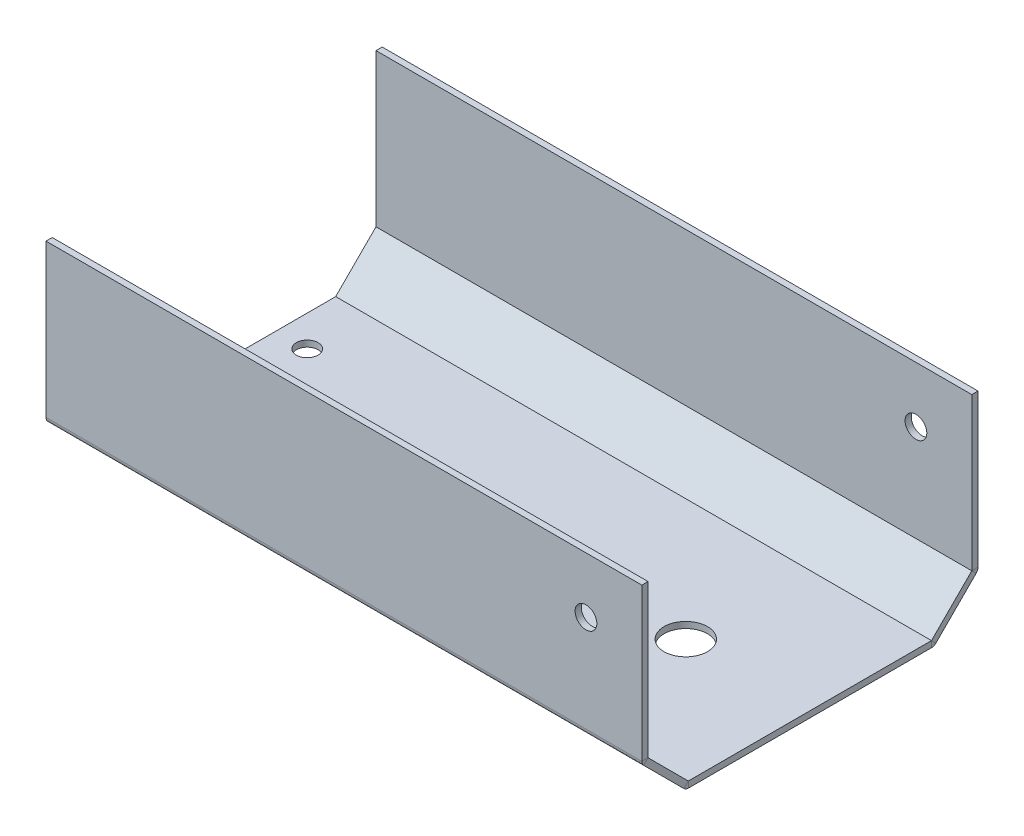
ISO-10303-21;
HEADER;
FILE_DESCRIPTION(('STEP AP214'),'2;1');
FILE_NAME('part.step','',(''),(''),'','','');
FILE_SCHEMA(('AUTOMOTIVE_DESIGN { 1 0 10303 214 1 1 1 1 }'));
ENDSEC;
DATA;
#1=APPLICATION_CONTEXT('core data for automotive mechanical design processes');
#2=APPLICATION_PROTOCOL_DEFINITION('international standard','automotive_design',2000,#1);
#3=PRODUCT_CONTEXT('',#1,'mechanical');
#4=PRODUCT('Part','Part','',(#3));
#5=PRODUCT_RELATED_PRODUCT_CATEGORY('part','',(#4));
#6=PRODUCT_DEFINITION_FORMATION('','',#4);
#7=PRODUCT_DEFINITION_CONTEXT('part definition',#1,'design');
#8=PRODUCT_DEFINITION('design','',#6,#7);
#9=PRODUCT_DEFINITION_SHAPE('','',#8);
#10=(LENGTH_UNIT() NAMED_UNIT(*) SI_UNIT(.MILLI.,.METRE.));
#11=(NAMED_UNIT(*) PLANE_ANGLE_UNIT() SI_UNIT($,.RADIAN.));
#12=(NAMED_UNIT(*) SI_UNIT($,.STERADIAN.) SOLID_ANGLE_UNIT());
#13=UNCERTAINTY_MEASURE_WITH_UNIT(LENGTH_MEASURE(1.E-05),#10,'distance_accuracy_value','');
#14=(GEOMETRIC_REPRESENTATION_CONTEXT(3) GLOBAL_UNCERTAINTY_ASSIGNED_CONTEXT((#13)) GLOBAL_UNIT_ASSIGNED_CONTEXT((#10,
#11,#12)) REPRESENTATION_CONTEXT('',''));
#15=CARTESIAN_POINT('',(0.,0.,0.));
#16=DIRECTION('',(0.,0.,1.));
#17=DIRECTION('',(1.,0.,0.));
#18=AXIS2_PLACEMENT_3D('',#15,#16,#17);
#19=CARTESIAN_POINT('',(0.,1.,-110.));
#20=DIRECTION('',(0.,-1.,0.));
#21=DIRECTION('',(0.,0.,-1.));
#22=AXIS2_PLACEMENT_3D('',#19,#20,#21);
#23=PLANE('',#22);
#24=CARTESIAN_POINT('',(5.,1.,-65.));
#25=DIRECTION('',(0.,1.,0.));
#26=DIRECTION('',(0.,0.,1.));
#27=AXIS2_PLACEMENT_3D('',#24,#25,#26);
#28=CIRCLE('',#27,1.75);
#29=CARTESIAN_POINT('',(5.,1.,-63.25));
#30=VERTEX_POINT('',#29);
#31=EDGE_CURVE('E340',#30,#30,#28,.T.);
#32=ORIENTED_EDGE('',*,*,#31,.F.);
#33=EDGE_LOOP('',(#32));
#34=FACE_BOUND('',#33,.T.);
#35=CARTESIAN_POINT('',(76.,1.,-55.));
#36=DIRECTION('',(0.,1.,0.));
#37=DIRECTION('',(0.,0.,1.));
#38=AXIS2_PLACEMENT_3D('',#35,#36,#37);
#39=CIRCLE('',#38,3.50000000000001);
#40=CARTESIAN_POINT('',(76.,1.,-51.5));
#41=VERTEX_POINT('',#40);
#42=EDGE_CURVE('E346',#41,#41,#39,.T.);
#43=ORIENTED_EDGE('',*,*,#42,.F.);
#44=EDGE_LOOP('',(#43));
#45=FACE_BOUND('',#44,.T.);
#46=CARTESIAN_POINT('',(5.,1.,-45.));
#47=DIRECTION('',(0.,1.,0.));
#48=DIRECTION('',(0.,0.,1.));
#49=AXIS2_PLACEMENT_3D('',#46,#47,#48);
#50=CIRCLE('',#49,1.75);
#51=CARTESIAN_POINT('',(5.,1.,-43.25));
#52=VERTEX_POINT('',#51);
#53=EDGE_CURVE('E334',#52,#52,#50,.T.);
#54=ORIENTED_EDGE('',*,*,#53,.F.);
#55=EDGE_LOOP('',(#54));
#56=FACE_BOUND('',#55,.T.);
#57=DIRECTION('',(0.,0.,1.));
#58=VECTOR('',#57,1.);
#59=CARTESIAN_POINT('',(0.,1.,0.));
#60=LINE('',#59,#58);
#61=CARTESIAN_POINT('',(0.,0.999999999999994,-74.5907864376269));
#62=VERTEX_POINT('',#61);
#63=CARTESIAN_POINT('',(0.,1.,-35.4092135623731));
#64=VERTEX_POINT('',#63);
#65=EDGE_CURVE('E52',#62,#64,#60,.T.);
#66=ORIENTED_EDGE('',*,*,#65,.T.);
#67=DIRECTION('',(1.,0.,0.));
#68=VECTOR('',#67,1.);
#69=CARTESIAN_POINT('',(0.,1.,-35.4092135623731));
#70=LINE('',#69,#68);
#71=CARTESIAN_POINT('',(96.,1.,-35.4092135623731));
#72=VERTEX_POINT('',#71);
#73=EDGE_CURVE('E361',#64,#72,#70,.T.);
#74=ORIENTED_EDGE('',*,*,#73,.T.);
#75=DIRECTION('',(0.,0.,-1.));
#76=VECTOR('',#75,1.);
#77=CARTESIAN_POINT('',(96.,1.,0.));
#78=LINE('',#77,#76);
#79=CARTESIAN_POINT('',(96.,1.,-74.5907864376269));
#80=VERTEX_POINT('',#79);
#81=EDGE_CURVE('E353',#72,#80,#78,.T.);
#82=ORIENTED_EDGE('',*,*,#81,.T.);
#83=DIRECTION('',(1.,0.,0.));
#84=VECTOR('',#83,1.);
#85=CARTESIAN_POINT('',(0.,1.,-74.5907864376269));
#86=LINE('',#85,#84);
#87=EDGE_CURVE('E349',#62,#80,#86,.T.);
#88=ORIENTED_EDGE('',*,*,#87,.F.);
#89=EDGE_LOOP('',(#66,#74,#82,#88));
#90=FACE_BOUND('',#89,.T.);
#91=ADVANCED_FACE('F48',(#34,#45,#56,#90),#23,.F.);
#92=CARTESIAN_POINT('',(0.,1.,0.));
#93=DIRECTION('',(1.,0.,0.));
#94=DIRECTION('',(0.,0.,-1.));
#95=AXIS2_PLACEMENT_3D('',#92,#93,#94);
#96=PLANE('',#95);
#97=DIRECTION('',(0.,0.,1.));
#98=VECTOR('',#97,1.);
#99=CARTESIAN_POINT('',(0.,0.,0.));
#100=LINE('',#99,#98);
#101=CARTESIAN_POINT('',(0.,0.,-74.5907864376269));
#102=VERTEX_POINT('',#101);
#103=CARTESIAN_POINT('',(0.,0.,-35.4092135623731));
#104=VERTEX_POINT('',#103);
#105=EDGE_CURVE('E71',#102,#104,#100,.T.);
#106=ORIENTED_EDGE('',*,*,#105,.T.);
#107=DIRECTION('',(0.,1.,0.));
#108=VECTOR('',#107,1.);
#109=CARTESIAN_POINT('',(0.,0.999999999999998,-35.4092135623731));
#110=LINE('',#109,#108);
#111=EDGE_CURVE('E364',#104,#64,#110,.T.);
#112=ORIENTED_EDGE('',*,*,#111,.T.);
#113=ORIENTED_EDGE('',*,*,#65,.F.);
#114=DIRECTION('',(0.,1.,0.));
#115=VECTOR('',#114,1.);
#116=CARTESIAN_POINT('',(0.,0.999999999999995,-74.5907864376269));
#117=LINE('',#116,#115);
#118=EDGE_CURVE('E358',#102,#62,#117,.T.);
#119=ORIENTED_EDGE('',*,*,#118,.F.);
#120=EDGE_LOOP('',(#106,#112,#113,#119));
#121=FACE_BOUND('',#120,.T.);
#122=ADVANCED_FACE('F377',(#121),#96,.F.);
#123=CARTESIAN_POINT('',(96.,1.,0.));
#124=DIRECTION('',(-1.,0.,0.));
#125=DIRECTION('',(0.,0.,1.));
#126=AXIS2_PLACEMENT_3D('',#123,#124,#125);
#127=PLANE('',#126);
#128=ORIENTED_EDGE('',*,*,#81,.F.);
#129=DIRECTION('',(0.,-1.,0.));
#130=VECTOR('',#129,1.);
#131=CARTESIAN_POINT('',(96.,0.999999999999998,-35.4092135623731));
#132=LINE('',#131,#130);
#133=CARTESIAN_POINT('',(96.,0.,-35.4092135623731));
#134=VERTEX_POINT('',#133);
#135=EDGE_CURVE('E12',#72,#134,#132,.T.);
#136=ORIENTED_EDGE('',*,*,#135,.T.);
#137=DIRECTION('',(0.,0.,-1.));
#138=VECTOR('',#137,1.);
#139=CARTESIAN_POINT('',(96.,0.,0.));
#140=LINE('',#139,#138);
#141=CARTESIAN_POINT('',(96.,0.,-74.5907864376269));
#142=VERTEX_POINT('',#141);
#143=EDGE_CURVE('E368',#134,#142,#140,.T.);
#144=ORIENTED_EDGE('',*,*,#143,.T.);
#145=DIRECTION('',(0.,-1.,0.));
#146=VECTOR('',#145,1.);
#147=CARTESIAN_POINT('',(96.,0.999999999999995,-74.5907864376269));
#148=LINE('',#147,#146);
#149=EDGE_CURVE('E352',#80,#142,#148,.T.);
#150=ORIENTED_EDGE('',*,*,#149,.F.);
#151=EDGE_LOOP('',(#128,#136,#144,#150));
#152=FACE_BOUND('',#151,.T.);
#153=ADVANCED_FACE('F50',(#152),#127,.F.);
#154=CARTESIAN_POINT('',(0.,0.,-110.));
#155=DIRECTION('',(0.,-1.,0.));
#156=DIRECTION('',(0.,0.,-1.));
#157=AXIS2_PLACEMENT_3D('',#154,#155,#156);
#158=PLANE('',#157);
#159=DIRECTION('',(1.,0.,0.));
#160=VECTOR('',#159,1.);
#161=CARTESIAN_POINT('',(0.,0.,-35.4092135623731));
#162=LINE('',#161,#160);
#163=EDGE_CURVE('E57',#104,#134,#162,.T.);
#164=ORIENTED_EDGE('',*,*,#163,.F.);
#165=ORIENTED_EDGE('',*,*,#105,.F.);
#166=DIRECTION('',(1.,0.,0.));
#167=VECTOR('',#166,1.);
#168=CARTESIAN_POINT('',(0.,0.,-74.5907864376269));
#169=LINE('',#168,#167);
#170=EDGE_CURVE('E356',#102,#142,#169,.T.);
#171=ORIENTED_EDGE('',*,*,#170,.T.);
#172=ORIENTED_EDGE('',*,*,#143,.F.);
#173=EDGE_LOOP('',(#164,#165,#171,#172));
#174=FACE_BOUND('',#173,.T.);
#175=CARTESIAN_POINT('',(5.,0.,-65.));
#176=DIRECTION('',(0.,1.,0.));
#177=DIRECTION('',(0.,0.,1.));
#178=AXIS2_PLACEMENT_3D('',#175,#176,#177);
#179=CIRCLE('',#178,1.75);
#180=CARTESIAN_POINT('',(5.,0.,-63.25));
#181=VERTEX_POINT('',#180);
#182=EDGE_CURVE('E337',#181,#181,#179,.T.);
#183=ORIENTED_EDGE('',*,*,#182,.T.);
#184=EDGE_LOOP('',(#183));
#185=FACE_BOUND('',#184,.T.);
#186=CARTESIAN_POINT('',(76.,0.,-55.));
#187=DIRECTION('',(0.,1.,0.));
#188=DIRECTION('',(0.,0.,1.));
#189=AXIS2_PLACEMENT_3D('',#186,#187,#188);
#190=CIRCLE('',#189,3.50000000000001);
#191=CARTESIAN_POINT('',(76.,0.,-51.5));
#192=VERTEX_POINT('',#191);
#193=EDGE_CURVE('E343',#192,#192,#190,.T.);
#194=ORIENTED_EDGE('',*,*,#193,.T.);
#195=EDGE_LOOP('',(#194));
#196=FACE_BOUND('',#195,.T.);
#197=CARTESIAN_POINT('',(5.,0.,-45.));
#198=DIRECTION('',(0.,1.,0.));
#199=DIRECTION('',(0.,0.,1.));
#200=AXIS2_PLACEMENT_3D('',#197,#198,#199);
#201=CIRCLE('',#200,1.75);
#202=CARTESIAN_POINT('',(5.,0.,-43.25));
#203=VERTEX_POINT('',#202);
#204=EDGE_CURVE('E331',#203,#203,#201,.T.);
#205=ORIENTED_EDGE('',*,*,#204,.T.);
#206=EDGE_LOOP('',(#205));
#207=FACE_BOUND('',#206,.T.);
#208=ADVANCED_FACE('F446',(#174,#185,#196,#207),#158,.T.);
#209=CARTESIAN_POINT('',(76.,1.,-55.));
#210=DIRECTION('',(0.,-1.,0.));
#211=DIRECTION('',(0.,0.,-1.));
#212=AXIS2_PLACEMENT_3D('',#209,#210,#211);
#213=CYLINDRICAL_SURFACE('',#212,3.50000000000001);
#214=ORIENTED_EDGE('',*,*,#42,.T.);
#215=EDGE_LOOP('',(#214));
#216=FACE_BOUND('',#215,.T.);
#217=ORIENTED_EDGE('',*,*,#193,.F.);
#218=EDGE_LOOP('',(#217));
#219=FACE_BOUND('',#218,.T.);
#220=ADVANCED_FACE('F449',(#216,#219),#213,.F.);
#221=CARTESIAN_POINT('',(5.,1.,-65.));
#222=DIRECTION('',(0.,-1.,0.));
#223=DIRECTION('',(0.,0.,-1.));
#224=AXIS2_PLACEMENT_3D('',#221,#222,#223);
#225=CYLINDRICAL_SURFACE('',#224,1.75);
#226=ORIENTED_EDGE('',*,*,#31,.T.);
#227=EDGE_LOOP('',(#226));
#228=FACE_BOUND('',#227,.T.);
#229=ORIENTED_EDGE('',*,*,#182,.F.);
#230=EDGE_LOOP('',(#229));
#231=FACE_BOUND('',#230,.T.);
#232=ADVANCED_FACE('F458',(#228,#231),#225,.F.);
#233=CARTESIAN_POINT('',(5.,1.,-45.));
#234=DIRECTION('',(0.,-1.,0.));
#235=DIRECTION('',(0.,0.,-1.));
#236=AXIS2_PLACEMENT_3D('',#233,#234,#235);
#237=CYLINDRICAL_SURFACE('',#236,1.75);
#238=ORIENTED_EDGE('',*,*,#53,.T.);
#239=EDGE_LOOP('',(#238));
#240=FACE_BOUND('',#239,.T.);
#241=ORIENTED_EDGE('',*,*,#204,.F.);
#242=EDGE_LOOP('',(#241));
#243=FACE_BOUND('',#242,.T.);
#244=ADVANCED_FACE('F456',(#240,#243),#237,.F.);
#245=CARTESIAN_POINT('',(96.,0.999999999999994,-74.5907864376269));
#246=DIRECTION('',(-1.,0.,0.));
#247=DIRECTION('',(0.,0.,1.));
#248=AXIS2_PLACEMENT_3D('',#245,#246,#247);
#249=PLANE('',#248);
#250=CARTESIAN_POINT('',(96.,1.,-74.5907864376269));
#251=DIRECTION('',(-1.,0.,0.));
#252=DIRECTION('',(0.,0.,1.));
#253=AXIS2_PLACEMENT_3D('',#250,#251,#252);
#254=CIRCLE('',#253,1.00000000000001);
#255=CARTESIAN_POINT('',(96.,0.292893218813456,-75.2978932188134));
#256=VERTEX_POINT('',#255);
#257=EDGE_CURVE('E328',#256,#142,#254,.T.);
#258=ORIENTED_EDGE('',*,*,#257,.F.);
#259=DIRECTION('',(0.,-0.707106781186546,-0.707106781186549));
#260=VECTOR('',#259,1.);
#261=CARTESIAN_POINT('',(96.,1.,-74.5907864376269));
#262=LINE('',#261,#260);
#263=EDGE_CURVE('E268',#80,#256,#262,.T.);
#264=ORIENTED_EDGE('',*,*,#263,.F.);
#265=ORIENTED_EDGE('',*,*,#149,.T.);
#266=EDGE_LOOP('',(#258,#264,#265));
#267=FACE_BOUND('',#266,.T.);
#268=ADVANCED_FACE('F402',(#267),#249,.F.);
#269=CARTESIAN_POINT('',(0.,1.,-74.5907864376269));
#270=DIRECTION('',(-1.,0.,0.));
#271=DIRECTION('',(0.,0.,1.));
#272=AXIS2_PLACEMENT_3D('',#269,#270,#271);
#273=CYLINDRICAL_SURFACE('',#272,1.00000000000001);
#274=CARTESIAN_POINT('',(0.,1.,-74.5907864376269));
#275=DIRECTION('',(-1.,0.,0.));
#276=DIRECTION('',(0.,0.,1.));
#277=AXIS2_PLACEMENT_3D('',#274,#275,#276);
#278=CIRCLE('',#277,1.00000000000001);
#279=CARTESIAN_POINT('',(0.,0.292893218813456,-75.2978932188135));
#280=VERTEX_POINT('',#279);
#281=EDGE_CURVE('E259',#280,#102,#278,.T.);
#282=ORIENTED_EDGE('',*,*,#281,.F.);
#283=DIRECTION('',(1.,0.,0.));
#284=VECTOR('',#283,1.);
#285=CARTESIAN_POINT('',(0.,0.292893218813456,-75.2978932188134));
#286=LINE('',#285,#284);
#287=EDGE_CURVE('E255',#280,#256,#286,.T.);
#288=ORIENTED_EDGE('',*,*,#287,.T.);
#289=ORIENTED_EDGE('',*,*,#257,.T.);
#290=ORIENTED_EDGE('',*,*,#170,.F.);
#291=EDGE_LOOP('',(#282,#288,#289,#290));
#292=FACE_BOUND('',#291,.T.);
#293=ADVANCED_FACE('F445',(#292),#273,.T.);
#294=CARTESIAN_POINT('',(0.,0.999999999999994,-74.5907864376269));
#295=DIRECTION('',(1.,0.,0.));
#296=DIRECTION('',(0.,0.,-1.));
#297=AXIS2_PLACEMENT_3D('',#294,#295,#296);
#298=PLANE('',#297);
#299=DIRECTION('',(0.,0.707106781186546,0.707106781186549));
#300=VECTOR('',#299,1.);
#301=CARTESIAN_POINT('',(0.,1.,-74.5907864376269));
#302=LINE('',#301,#300);
#303=EDGE_CURVE('E256',#280,#62,#302,.T.);
#304=ORIENTED_EDGE('',*,*,#303,.F.);
#305=ORIENTED_EDGE('',*,*,#281,.T.);
#306=ORIENTED_EDGE('',*,*,#118,.T.);
#307=EDGE_LOOP('',(#304,#305,#306));
#308=FACE_BOUND('',#307,.T.);
#309=ADVANCED_FACE('F442',(#308),#298,.F.);
#310=CARTESIAN_POINT('',(0.,32.0831388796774,-82.0831388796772));
#311=DIRECTION('',(0.,0.,-1.));
#312=DIRECTION('',(0.,1.,0.));
#313=AXIS2_PLACEMENT_3D('',#310,#311,#312);
#314=PLANE('',#313);
#315=DIRECTION('',(1.,0.,0.));
#316=VECTOR('',#315,1.);
#317=CARTESIAN_POINT('',(0.,7.49235244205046,-82.0831388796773));
#318=LINE('',#317,#316);
#319=CARTESIAN_POINT('',(0.,7.49235244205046,-82.0831388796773));
#320=VERTEX_POINT('',#319);
#321=CARTESIAN_POINT('',(96.,7.49235244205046,-82.0831388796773));
#322=VERTEX_POINT('',#321);
#323=EDGE_CURVE('E292',#320,#322,#318,.T.);
#324=ORIENTED_EDGE('',*,*,#323,.F.);
#325=DIRECTION('',(0.,-1.,0.));
#326=VECTOR('',#325,1.);
#327=CARTESIAN_POINT('',(0.,-77.9168611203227,-82.0831388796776));
#328=LINE('',#327,#326);
#329=CARTESIAN_POINT('',(0.,32.0831388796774,-82.0831388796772));
#330=VERTEX_POINT('',#329);
#331=EDGE_CURVE('E309',#330,#320,#328,.T.);
#332=ORIENTED_EDGE('',*,*,#331,.F.);
#333=DIRECTION('',(-1.,0.,0.));
#334=VECTOR('',#333,1.);
#335=CARTESIAN_POINT('',(0.,32.0831388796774,-82.0831388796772));
#336=LINE('',#335,#334);
#337=CARTESIAN_POINT('',(96.,32.0831388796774,-82.0831388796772));
#338=VERTEX_POINT('',#337);
#339=EDGE_CURVE('E320',#338,#330,#336,.T.);
#340=ORIENTED_EDGE('',*,*,#339,.F.);
#341=DIRECTION('',(0.,1.,0.));
#342=VECTOR('',#341,1.);
#343=CARTESIAN_POINT('',(96.,-77.9168611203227,-82.0831388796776));
#344=LINE('',#343,#342);
#345=EDGE_CURVE('E312',#322,#338,#344,.T.);
#346=ORIENTED_EDGE('',*,*,#345,.F.);
#347=EDGE_LOOP('',(#324,#332,#340,#346));
#348=FACE_BOUND('',#347,.T.);
#349=CARTESIAN_POINT('',(87.,23.0831388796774,-82.0831388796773));
#350=DIRECTION('',(0.,0.,1.));
#351=DIRECTION('',(0.,-1.,0.));
#352=AXIS2_PLACEMENT_3D('',#349,#350,#351);
#353=CIRCLE('',#352,1.75);
#354=CARTESIAN_POINT('',(87.,21.3331388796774,-82.0831388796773));
#355=VERTEX_POINT('',#354);
#356=EDGE_CURVE('E322',#355,#355,#353,.T.);
#357=ORIENTED_EDGE('',*,*,#356,.T.);
#358=EDGE_LOOP('',(#357));
#359=FACE_BOUND('',#358,.T.);
#360=ADVANCED_FACE('F550',(#348,#359),#314,.T.);
#361=CARTESIAN_POINT('',(0.,32.0831388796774,-81.0831388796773));
#362=DIRECTION('',(0.,-1.,0.));
#363=DIRECTION('',(1.,0.,0.));
#364=AXIS2_PLACEMENT_3D('',#361,#362,#363);
#365=PLANE('',#364);
#366=ORIENTED_EDGE('',*,*,#339,.T.);
#367=DIRECTION('',(0.,0.,-1.));
#368=VECTOR('',#367,1.);
#369=CARTESIAN_POINT('',(0.,32.0831388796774,-81.0831388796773));
#370=LINE('',#369,#368);
#371=CARTESIAN_POINT('',(0.,32.0831388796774,-81.0831388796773));
#372=VERTEX_POINT('',#371);
#373=EDGE_CURVE('E303',#372,#330,#370,.T.);
#374=ORIENTED_EDGE('',*,*,#373,.F.);
#375=DIRECTION('',(-1.,0.,0.));
#376=VECTOR('',#375,1.);
#377=CARTESIAN_POINT('',(0.,32.0831388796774,-81.0831388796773));
#378=LINE('',#377,#376);
#379=CARTESIAN_POINT('',(96.,32.0831388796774,-81.0831388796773));
#380=VERTEX_POINT('',#379);
#381=EDGE_CURVE('E276',#380,#372,#378,.T.);
#382=ORIENTED_EDGE('',*,*,#381,.F.);
#383=DIRECTION('',(0.,0.,-1.));
#384=VECTOR('',#383,1.);
#385=CARTESIAN_POINT('',(96.,32.0831388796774,-81.0831388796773));
#386=LINE('',#385,#384);
#387=EDGE_CURVE('E317',#380,#338,#386,.T.);
#388=ORIENTED_EDGE('',*,*,#387,.T.);
#389=EDGE_LOOP('',(#366,#374,#382,#388));
#390=FACE_BOUND('',#389,.T.);
#391=ADVANCED_FACE('F427',(#390),#365,.F.);
#392=CARTESIAN_POINT('',(96.,-77.9168611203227,-81.0831388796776));
#393=DIRECTION('',(-1.,0.,0.));
#394=DIRECTION('',(0.,-1.,0.));
#395=AXIS2_PLACEMENT_3D('',#392,#393,#394);
#396=PLANE('',#395);
#397=DIRECTION('',(0.,1.,0.));
#398=VECTOR('',#397,1.);
#399=CARTESIAN_POINT('',(96.,-77.9168611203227,-81.0831388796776));
#400=LINE('',#399,#398);
#401=CARTESIAN_POINT('',(96.,7.49235244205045,-81.0831388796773));
#402=VERTEX_POINT('',#401);
#403=EDGE_CURVE('E278',#402,#380,#400,.T.);
#404=ORIENTED_EDGE('',*,*,#403,.F.);
#405=DIRECTION('',(0.,0.,-1.));
#406=VECTOR('',#405,1.);
#407=CARTESIAN_POINT('',(96.,7.49235244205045,-81.0831388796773));
#408=LINE('',#407,#406);
#409=EDGE_CURVE('E314',#402,#322,#408,.T.);
#410=ORIENTED_EDGE('',*,*,#409,.T.);
#411=ORIENTED_EDGE('',*,*,#345,.T.);
#412=ORIENTED_EDGE('',*,*,#387,.F.);
#413=EDGE_LOOP('',(#404,#410,#411,#412));
#414=FACE_BOUND('',#413,.T.);
#415=ADVANCED_FACE('F422',(#414),#396,.F.);
#416=CARTESIAN_POINT('',(0.,-77.9168611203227,-81.0831388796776));
#417=DIRECTION('',(1.,0.,0.));
#418=DIRECTION('',(0.,1.,0.));
#419=AXIS2_PLACEMENT_3D('',#416,#417,#418);
#420=PLANE('',#419);
#421=ORIENTED_EDGE('',*,*,#331,.T.);
#422=DIRECTION('',(0.,0.,1.));
#423=VECTOR('',#422,1.);
#424=CARTESIAN_POINT('',(0.,7.49235244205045,-81.0831388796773));
#425=LINE('',#424,#423);
#426=CARTESIAN_POINT('',(0.,7.49235244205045,-81.0831388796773));
#427=VERTEX_POINT('',#426);
#428=EDGE_CURVE('E306',#320,#427,#425,.T.);
#429=ORIENTED_EDGE('',*,*,#428,.T.);
#430=DIRECTION('',(0.,-1.,0.));
#431=VECTOR('',#430,1.);
#432=CARTESIAN_POINT('',(0.,-77.9168611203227,-81.0831388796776));
#433=LINE('',#432,#431);
#434=EDGE_CURVE('E283',#372,#427,#433,.T.);
#435=ORIENTED_EDGE('',*,*,#434,.F.);
#436=ORIENTED_EDGE('',*,*,#373,.T.);
#437=EDGE_LOOP('',(#421,#429,#435,#436));
#438=FACE_BOUND('',#437,.T.);
#439=ADVANCED_FACE('F430',(#438),#420,.F.);
#440=CARTESIAN_POINT('',(87.,23.0831388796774,-81.0831388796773));
#441=DIRECTION('',(0.,0.,-1.));
#442=DIRECTION('',(0.,1.,0.));
#443=AXIS2_PLACEMENT_3D('',#440,#441,#442);
#444=CYLINDRICAL_SURFACE('',#443,1.75);
#445=CARTESIAN_POINT('',(87.,23.0831388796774,-81.0831388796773));
#446=DIRECTION('',(0.,0.,1.));
#447=DIRECTION('',(0.,-1.,0.));
#448=AXIS2_PLACEMENT_3D('',#445,#446,#447);
#449=CIRCLE('',#448,1.75);
#450=CARTESIAN_POINT('',(87.,21.3331388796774,-81.0831388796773));
#451=VERTEX_POINT('',#450);
#452=EDGE_CURVE('E300',#451,#451,#449,.T.);
#453=ORIENTED_EDGE('',*,*,#452,.T.);
#454=EDGE_LOOP('',(#453));
#455=FACE_BOUND('',#454,.T.);
#456=ORIENTED_EDGE('',*,*,#356,.F.);
#457=EDGE_LOOP('',(#456));
#458=FACE_BOUND('',#457,.T.);
#459=ADVANCED_FACE('F587',(#455,#458),#444,.F.);
#460=CARTESIAN_POINT('',(0.,7.49235244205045,-81.0831388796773));
#461=DIRECTION('',(1.,0.,0.));
#462=DIRECTION('',(0.,0.707106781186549,-0.707106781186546));
#463=AXIS2_PLACEMENT_3D('',#460,#461,#462);
#464=PLANE('',#463);
#465=ORIENTED_EDGE('',*,*,#428,.F.);
#466=CARTESIAN_POINT('',(0.,7.49235244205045,-81.0831388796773));
#467=DIRECTION('',(-1.,0.,0.));
#468=DIRECTION('',(0.,-0.707106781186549,0.707106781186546));
#469=AXIS2_PLACEMENT_3D('',#466,#467,#468);
#470=CIRCLE('',#469,1.00000000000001);
#471=CARTESIAN_POINT('',(0.,6.7852456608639,-81.7902456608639));
#472=VERTEX_POINT('',#471);
#473=EDGE_CURVE('E297',#320,#472,#470,.T.);
#474=ORIENTED_EDGE('',*,*,#473,.T.);
#475=DIRECTION('',(0.,0.707106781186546,0.707106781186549));
#476=VECTOR('',#475,1.);
#477=CARTESIAN_POINT('',(0.,7.49235244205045,-81.0831388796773));
#478=LINE('',#477,#476);
#479=EDGE_CURVE('E294',#472,#427,#478,.T.);
#480=ORIENTED_EDGE('',*,*,#479,.T.);
#481=EDGE_LOOP('',(#465,#474,#480));
#482=FACE_BOUND('',#481,.T.);
#483=ADVANCED_FACE('F434',(#482),#464,.F.);
#484=CARTESIAN_POINT('',(0.,7.49235244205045,-81.0831388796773));
#485=DIRECTION('',(-1.,0.,0.));
#486=DIRECTION('',(0.,-0.707106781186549,0.707106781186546));
#487=AXIS2_PLACEMENT_3D('',#484,#485,#486);
#488=CYLINDRICAL_SURFACE('',#487,1.00000000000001);
#489=ORIENTED_EDGE('',*,*,#473,.F.);
#490=ORIENTED_EDGE('',*,*,#323,.T.);
#491=CARTESIAN_POINT('',(96.,7.49235244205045,-81.0831388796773));
#492=DIRECTION('',(-1.,0.,0.));
#493=DIRECTION('',(0.,-0.707106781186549,0.707106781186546));
#494=AXIS2_PLACEMENT_3D('',#491,#492,#493);
#495=CIRCLE('',#494,1.00000000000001);
#496=CARTESIAN_POINT('',(96.,6.7852456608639,-81.7902456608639));
#497=VERTEX_POINT('',#496);
#498=EDGE_CURVE('E289',#322,#497,#495,.T.);
#499=ORIENTED_EDGE('',*,*,#498,.T.);
#500=DIRECTION('',(1.,0.,0.));
#501=VECTOR('',#500,1.);
#502=CARTESIAN_POINT('',(0.,6.7852456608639,-81.7902456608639));
#503=LINE('',#502,#501);
#504=EDGE_CURVE('E263',#472,#497,#503,.T.);
#505=ORIENTED_EDGE('',*,*,#504,.F.);
#506=EDGE_LOOP('',(#489,#490,#499,#505));
#507=FACE_BOUND('',#506,.T.);
#508=ADVANCED_FACE('F606',(#507),#488,.T.);
#509=CARTESIAN_POINT('',(96.,7.49235244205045,-81.0831388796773));
#510=DIRECTION('',(-1.,0.,0.));
#511=DIRECTION('',(0.,-0.707106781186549,0.707106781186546));
#512=AXIS2_PLACEMENT_3D('',#509,#510,#511);
#513=PLANE('',#512);
#514=ORIENTED_EDGE('',*,*,#498,.F.);
#515=ORIENTED_EDGE('',*,*,#409,.F.);
#516=DIRECTION('',(0.,-0.707106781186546,-0.707106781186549));
#517=VECTOR('',#516,1.);
#518=CARTESIAN_POINT('',(96.,7.49235244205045,-81.0831388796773));
#519=LINE('',#518,#517);
#520=EDGE_CURVE('E286',#402,#497,#519,.T.);
#521=ORIENTED_EDGE('',*,*,#520,.T.);
#522=EDGE_LOOP('',(#514,#515,#521));
#523=FACE_BOUND('',#522,.T.);
#524=ADVANCED_FACE('F414',(#523),#513,.F.);
#525=CARTESIAN_POINT('',(0.,32.0831388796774,-81.0831388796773));
#526=DIRECTION('',(0.,0.,-1.));
#527=DIRECTION('',(0.,1.,0.));
#528=AXIS2_PLACEMENT_3D('',#525,#526,#527);
#529=PLANE('',#528);
#530=ORIENTED_EDGE('',*,*,#452,.F.);
#531=EDGE_LOOP('',(#530));
#532=FACE_BOUND('',#531,.T.);
#533=ORIENTED_EDGE('',*,*,#434,.T.);
#534=DIRECTION('',(1.,0.,0.));
#535=VECTOR('',#534,1.);
#536=CARTESIAN_POINT('',(0.,7.49235244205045,-81.0831388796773));
#537=LINE('',#536,#535);
#538=EDGE_CURVE('E280',#427,#402,#537,.T.);
#539=ORIENTED_EDGE('',*,*,#538,.T.);
#540=ORIENTED_EDGE('',*,*,#403,.T.);
#541=ORIENTED_EDGE('',*,*,#381,.T.);
#542=EDGE_LOOP('',(#533,#539,#540,#541));
#543=FACE_BOUND('',#542,.T.);
#544=ADVANCED_FACE('F419',(#532,#543),#529,.F.);
#545=CARTESIAN_POINT('',(0.,25.4593796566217,-99.0501660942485));
#546=DIRECTION('',(0.,-0.707106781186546,-0.707106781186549));
#547=DIRECTION('',(0.,0.707106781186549,-0.707106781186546));
#548=AXIS2_PLACEMENT_3D('',#545,#546,#547);
#549=PLANE('',#548);
#550=DIRECTION('',(0.,-0.707106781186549,0.707106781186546));
#551=VECTOR('',#550,1.);
#552=CARTESIAN_POINT('',(0.,-52.3223662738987,-21.2684201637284));
#553=LINE('',#552,#551);
#554=EDGE_CURVE('E273',#427,#62,#553,.T.);
#555=ORIENTED_EDGE('',*,*,#554,.T.);
#556=ORIENTED_EDGE('',*,*,#87,.T.);
#557=DIRECTION('',(0.,0.707106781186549,-0.707106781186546));
#558=VECTOR('',#557,1.);
#559=CARTESIAN_POINT('',(96.,-52.3223662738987,-21.2684201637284));
#560=LINE('',#559,#558);
#561=EDGE_CURVE('E271',#80,#402,#560,.T.);
#562=ORIENTED_EDGE('',*,*,#561,.T.);
#563=ORIENTED_EDGE('',*,*,#538,.F.);
#564=EDGE_LOOP('',(#555,#556,#562,#563));
#565=FACE_BOUND('',#564,.T.);
#566=ADVANCED_FACE('F407',(#565),#549,.F.);
#567=CARTESIAN_POINT('',(96.,-52.3223662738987,-21.2684201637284));
#568=DIRECTION('',(-1.,0.,0.));
#569=DIRECTION('',(0.,-0.707106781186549,0.707106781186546));
#570=AXIS2_PLACEMENT_3D('',#567,#568,#569);
#571=PLANE('',#570);
#572=ORIENTED_EDGE('',*,*,#561,.F.);
#573=ORIENTED_EDGE('',*,*,#263,.T.);
#574=DIRECTION('',(0.,0.707106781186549,-0.707106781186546));
#575=VECTOR('',#574,1.);
#576=CARTESIAN_POINT('',(96.,-53.0294730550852,-21.975526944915));
#577=LINE('',#576,#575);
#578=EDGE_CURVE('E266',#256,#497,#577,.T.);
#579=ORIENTED_EDGE('',*,*,#578,.T.);
#580=ORIENTED_EDGE('',*,*,#520,.F.);
#581=EDGE_LOOP('',(#572,#573,#579,#580));
#582=FACE_BOUND('',#581,.T.);
#583=ADVANCED_FACE('F410',(#582),#571,.F.);
#584=CARTESIAN_POINT('',(0.,24.7522728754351,-99.757272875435));
#585=DIRECTION('',(0.,-0.707106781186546,-0.707106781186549));
#586=DIRECTION('',(0.,0.707106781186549,-0.707106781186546));
#587=AXIS2_PLACEMENT_3D('',#584,#585,#586);
#588=PLANE('',#587);
#589=ORIENTED_EDGE('',*,*,#287,.F.);
#590=DIRECTION('',(0.,-0.707106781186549,0.707106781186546));
#591=VECTOR('',#590,1.);
#592=CARTESIAN_POINT('',(0.,-53.0294730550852,-21.975526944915));
#593=LINE('',#592,#591);
#594=EDGE_CURVE('E260',#472,#280,#593,.T.);
#595=ORIENTED_EDGE('',*,*,#594,.F.);
#596=ORIENTED_EDGE('',*,*,#504,.T.);
#597=ORIENTED_EDGE('',*,*,#578,.F.);
#598=EDGE_LOOP('',(#589,#595,#596,#597));
#599=FACE_BOUND('',#598,.T.);
#600=ADVANCED_FACE('F654',(#599),#588,.T.);
#601=CARTESIAN_POINT('',(0.,-52.3223662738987,-21.2684201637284));
#602=DIRECTION('',(1.,0.,0.));
#603=DIRECTION('',(0.,0.707106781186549,-0.707106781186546));
#604=AXIS2_PLACEMENT_3D('',#601,#602,#603);
#605=PLANE('',#604);
#606=ORIENTED_EDGE('',*,*,#594,.T.);
#607=ORIENTED_EDGE('',*,*,#303,.T.);
#608=ORIENTED_EDGE('',*,*,#554,.F.);
#609=ORIENTED_EDGE('',*,*,#479,.F.);
#610=EDGE_LOOP('',(#606,#607,#608,#609));
#611=FACE_BOUND('',#610,.T.);
#612=ADVANCED_FACE('F438',(#611),#605,.F.);
#613=CARTESIAN_POINT('',(0.,0.999999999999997,-35.4092135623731));
#614=DIRECTION('',(-1.,0.,0.));
#615=DIRECTION('',(0.,0.,1.));
#616=AXIS2_PLACEMENT_3D('',#613,#614,#615);
#617=PLANE('',#616);
#618=CARTESIAN_POINT('',(0.,1.,-35.4092135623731));
#619=DIRECTION('',(1.,0.,0.));
#620=DIRECTION('',(0.,0.,-1.));
#621=AXIS2_PLACEMENT_3D('',#618,#619,#620);
#622=CIRCLE('',#621,1.);
#623=CARTESIAN_POINT('',(0.,0.292893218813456,-34.7021067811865));
#624=VERTEX_POINT('',#623);
#625=EDGE_CURVE('E253',#624,#104,#622,.T.);
#626=ORIENTED_EDGE('',*,*,#625,.F.);
#627=DIRECTION('',(0.,0.707106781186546,-0.707106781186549));
#628=VECTOR('',#627,1.);
#629=CARTESIAN_POINT('',(0.,1.,-35.4092135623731));
#630=LINE('',#629,#628);
#631=EDGE_CURVE('E247',#624,#64,#630,.T.);
#632=ORIENTED_EDGE('',*,*,#631,.T.);
#633=ORIENTED_EDGE('',*,*,#111,.F.);
#634=EDGE_LOOP('',(#626,#632,#633));
#635=FACE_BOUND('',#634,.T.);
#636=ADVANCED_FACE('F380',(#635),#617,.T.);
#637=CARTESIAN_POINT('',(96.,1.,-35.4092135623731));
#638=DIRECTION('',(1.,0.,0.));
#639=DIRECTION('',(0.,0.,-1.));
#640=AXIS2_PLACEMENT_3D('',#637,#638,#639);
#641=CYLINDRICAL_SURFACE('',#640,1.);
#642=CARTESIAN_POINT('',(96.,1.,-35.4092135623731));
#643=DIRECTION('',(1.,0.,0.));
#644=DIRECTION('',(0.,0.,-1.));
#645=AXIS2_PLACEMENT_3D('',#642,#643,#644);
#646=CIRCLE('',#645,1.);
#647=CARTESIAN_POINT('',(96.,0.292893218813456,-34.7021067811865));
#648=VERTEX_POINT('',#647);
#649=EDGE_CURVE('E251',#648,#134,#646,.T.);
#650=ORIENTED_EDGE('',*,*,#649,.F.);
#651=DIRECTION('',(1.,0.,0.));
#652=VECTOR('',#651,1.);
#653=CARTESIAN_POINT('',(0.,0.292893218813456,-34.7021067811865));
#654=LINE('',#653,#652);
#655=EDGE_CURVE('E198',#624,#648,#654,.T.);
#656=ORIENTED_EDGE('',*,*,#655,.F.);
#657=ORIENTED_EDGE('',*,*,#625,.T.);
#658=ORIENTED_EDGE('',*,*,#163,.T.);
#659=EDGE_LOOP('',(#650,#656,#657,#658));
#660=FACE_BOUND('',#659,.T.);
#661=ADVANCED_FACE('F394',(#660),#641,.T.);
#662=CARTESIAN_POINT('',(96.,0.999999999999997,-35.4092135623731));
#663=DIRECTION('',(1.,0.,0.));
#664=DIRECTION('',(0.,0.,-1.));
#665=AXIS2_PLACEMENT_3D('',#662,#663,#664);
#666=PLANE('',#665);
#667=DIRECTION('',(0.,-0.707106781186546,0.707106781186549));
#668=VECTOR('',#667,1.);
#669=CARTESIAN_POINT('',(96.,1.,-35.4092135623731));
#670=LINE('',#669,#668);
#671=EDGE_CURVE('E210',#72,#648,#670,.T.);
#672=ORIENTED_EDGE('',*,*,#671,.T.);
#673=ORIENTED_EDGE('',*,*,#649,.T.);
#674=ORIENTED_EDGE('',*,*,#135,.F.);
#675=EDGE_LOOP('',(#672,#673,#674));
#676=FACE_BOUND('',#675,.T.);
#677=ADVANCED_FACE('F397',(#676),#666,.T.);
#678=CARTESIAN_POINT('',(0.,-77.9168611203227,-27.9168611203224));
#679=DIRECTION('',(0.,0.,1.));
#680=DIRECTION('',(0.,-1.,0.));
#681=AXIS2_PLACEMENT_3D('',#678,#679,#680);
#682=PLANE('',#681);
#683=CARTESIAN_POINT('',(87.,23.0831388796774,-27.9168611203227));
#684=DIRECTION('',(0.,0.,-1.));
#685=DIRECTION('',(0.,1.,0.));
#686=AXIS2_PLACEMENT_3D('',#683,#684,#685);
#687=CIRCLE('',#686,1.75);
#688=CARTESIAN_POINT('',(87.,24.8331388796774,-27.9168611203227));
#689=VERTEX_POINT('',#688);
#690=EDGE_CURVE('E244',#689,#689,#687,.T.);
#691=ORIENTED_EDGE('',*,*,#690,.T.);
#692=EDGE_LOOP('',(#691));
#693=FACE_BOUND('',#692,.T.);
#694=DIRECTION('',(0.,1.,0.));
#695=VECTOR('',#694,1.);
#696=CARTESIAN_POINT('',(0.,32.0831388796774,-27.9168611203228));
#697=LINE('',#696,#695);
#698=CARTESIAN_POINT('',(0.,7.49235244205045,-27.9168611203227));
#699=VERTEX_POINT('',#698);
#700=CARTESIAN_POINT('',(0.,32.0831388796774,-27.9168611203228));
#701=VERTEX_POINT('',#700);
#702=EDGE_CURVE('E188',#699,#701,#697,.T.);
#703=ORIENTED_EDGE('',*,*,#702,.F.);
#704=DIRECTION('',(1.,0.,0.));
#705=VECTOR('',#704,1.);
#706=CARTESIAN_POINT('',(0.,7.49235244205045,-27.9168611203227));
#707=LINE('',#706,#705);
#708=CARTESIAN_POINT('',(96.,7.49235244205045,-27.9168611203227));
#709=VERTEX_POINT('',#708);
#710=EDGE_CURVE('E242',#699,#709,#707,.T.);
#711=ORIENTED_EDGE('',*,*,#710,.T.);
#712=DIRECTION('',(0.,-1.,0.));
#713=VECTOR('',#712,1.);
#714=CARTESIAN_POINT('',(96.,32.0831388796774,-27.9168611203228));
#715=LINE('',#714,#713);
#716=CARTESIAN_POINT('',(96.,32.0831388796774,-27.9168611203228));
#717=VERTEX_POINT('',#716);
#718=EDGE_CURVE('E183',#717,#709,#715,.T.);
#719=ORIENTED_EDGE('',*,*,#718,.F.);
#720=DIRECTION('',(1.,0.,0.));
#721=VECTOR('',#720,1.);
#722=CARTESIAN_POINT('',(0.,32.0831388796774,-27.9168611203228));
#723=LINE('',#722,#721);
#724=EDGE_CURVE('E234',#701,#717,#723,.T.);
#725=ORIENTED_EDGE('',*,*,#724,.F.);
#726=EDGE_LOOP('',(#703,#711,#719,#725));
#727=FACE_BOUND('',#726,.T.);
#728=ADVANCED_FACE('F701',(#693,#727),#682,.T.);
#729=CARTESIAN_POINT('',(87.,23.0831388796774,-28.9168611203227));
#730=DIRECTION('',(0.,0.,1.));
#731=DIRECTION('',(0.,-1.,0.));
#732=AXIS2_PLACEMENT_3D('',#729,#730,#731);
#733=CYLINDRICAL_SURFACE('',#732,1.75);
#734=CARTESIAN_POINT('',(87.,23.0831388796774,-28.9168611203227));
#735=DIRECTION('',(0.,0.,-1.));
#736=DIRECTION('',(0.,1.,0.));
#737=AXIS2_PLACEMENT_3D('',#734,#735,#736);
#738=CIRCLE('',#737,1.75);
#739=CARTESIAN_POINT('',(87.,24.8331388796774,-28.9168611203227));
#740=VERTEX_POINT('',#739);
#741=EDGE_CURVE('E239',#740,#740,#738,.T.);
#742=ORIENTED_EDGE('',*,*,#741,.T.);
#743=EDGE_LOOP('',(#742));
#744=FACE_BOUND('',#743,.T.);
#745=ORIENTED_EDGE('',*,*,#690,.F.);
#746=EDGE_LOOP('',(#745));
#747=FACE_BOUND('',#746,.T.);
#748=ADVANCED_FACE('F711',(#744,#747),#733,.F.);
#749=CARTESIAN_POINT('',(96.,32.0831388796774,-28.9168611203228));
#750=DIRECTION('',(-1.,0.,0.));
#751=DIRECTION('',(0.,1.,0.));
#752=AXIS2_PLACEMENT_3D('',#749,#750,#751);
#753=PLANE('',#752);
#754=DIRECTION('',(0.,0.,1.));
#755=VECTOR('',#754,1.);
#756=CARTESIAN_POINT('',(96.,7.49235244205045,-28.9168611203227));
#757=LINE('',#756,#755);
#758=CARTESIAN_POINT('',(96.,7.49235244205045,-28.9168611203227));
#759=VERTEX_POINT('',#758);
#760=EDGE_CURVE('E179',#759,#709,#757,.T.);
#761=ORIENTED_EDGE('',*,*,#760,.F.);
#762=DIRECTION('',(0.,-1.,0.));
#763=VECTOR('',#762,1.);
#764=CARTESIAN_POINT('',(96.,32.0831388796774,-28.9168611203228));
#765=LINE('',#764,#763);
#766=CARTESIAN_POINT('',(96.,32.0831388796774,-28.9168611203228));
#767=VERTEX_POINT('',#766);
#768=EDGE_CURVE('E164',#767,#759,#765,.T.);
#769=ORIENTED_EDGE('',*,*,#768,.F.);
#770=DIRECTION('',(0.,0.,1.));
#771=VECTOR('',#770,1.);
#772=CARTESIAN_POINT('',(96.,32.0831388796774,-28.9168611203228));
#773=LINE('',#772,#771);
#774=EDGE_CURVE('E237',#767,#717,#773,.T.);
#775=ORIENTED_EDGE('',*,*,#774,.T.);
#776=ORIENTED_EDGE('',*,*,#718,.T.);
#777=EDGE_LOOP('',(#761,#769,#775,#776));
#778=FACE_BOUND('',#777,.T.);
#779=ADVANCED_FACE('F181',(#778),#753,.F.);
#780=CARTESIAN_POINT('',(0.,32.0831388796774,-28.9168611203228));
#781=DIRECTION('',(0.,-1.,0.));
#782=DIRECTION('',(-1.,0.,0.));
#783=AXIS2_PLACEMENT_3D('',#780,#781,#782);
#784=PLANE('',#783);
#785=ORIENTED_EDGE('',*,*,#724,.T.);
#786=ORIENTED_EDGE('',*,*,#774,.F.);
#787=DIRECTION('',(1.,0.,0.));
#788=VECTOR('',#787,1.);
#789=CARTESIAN_POINT('',(0.,32.0831388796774,-28.9168611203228));
#790=LINE('',#789,#788);
#791=CARTESIAN_POINT('',(0.,32.0831388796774,-28.9168611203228));
#792=VERTEX_POINT('',#791);
#793=EDGE_CURVE('E172',#792,#767,#790,.T.);
#794=ORIENTED_EDGE('',*,*,#793,.F.);
#795=DIRECTION('',(0.,0.,1.));
#796=VECTOR('',#795,1.);
#797=CARTESIAN_POINT('',(0.,32.0831388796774,-28.9168611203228));
#798=LINE('',#797,#796);
#799=EDGE_CURVE('E231',#792,#701,#798,.T.);
#800=ORIENTED_EDGE('',*,*,#799,.T.);
#801=EDGE_LOOP('',(#785,#786,#794,#800));
#802=FACE_BOUND('',#801,.T.);
#803=ADVANCED_FACE('F732',(#802),#784,.F.);
#804=CARTESIAN_POINT('',(0.,32.0831388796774,-28.9168611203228));
#805=DIRECTION('',(1.,0.,0.));
#806=DIRECTION('',(0.,-1.,0.));
#807=AXIS2_PLACEMENT_3D('',#804,#805,#806);
#808=PLANE('',#807);
#809=DIRECTION('',(0.,0.,-1.));
#810=VECTOR('',#809,1.);
#811=CARTESIAN_POINT('',(0.,7.49235244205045,-28.9168611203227));
#812=LINE('',#811,#810);
#813=CARTESIAN_POINT('',(0.,7.49235244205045,-28.9168611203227));
#814=VERTEX_POINT('',#813);
#815=EDGE_CURVE('E223',#699,#814,#812,.T.);
#816=ORIENTED_EDGE('',*,*,#815,.F.);
#817=ORIENTED_EDGE('',*,*,#702,.T.);
#818=ORIENTED_EDGE('',*,*,#799,.F.);
#819=DIRECTION('',(0.,1.,0.));
#820=VECTOR('',#819,1.);
#821=CARTESIAN_POINT('',(0.,32.0831388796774,-28.9168611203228));
#822=LINE('',#821,#820);
#823=EDGE_CURVE('E221',#814,#792,#822,.T.);
#824=ORIENTED_EDGE('',*,*,#823,.F.);
#825=EDGE_LOOP('',(#816,#817,#818,#824));
#826=FACE_BOUND('',#825,.T.);
#827=ADVANCED_FACE('F742',(#826),#808,.F.);
#828=CARTESIAN_POINT('',(96.,7.49235244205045,-28.9168611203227));
#829=DIRECTION('',(1.,0.,0.));
#830=DIRECTION('',(0.,-0.707106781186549,-0.707106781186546));
#831=AXIS2_PLACEMENT_3D('',#828,#829,#830);
#832=PLANE('',#831);
#833=ORIENTED_EDGE('',*,*,#760,.T.);
#834=CARTESIAN_POINT('',(96.,7.49235244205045,-28.9168611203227));
#835=DIRECTION('',(1.,0.,0.));
#836=DIRECTION('',(0.,-0.707106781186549,-0.707106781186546));
#837=AXIS2_PLACEMENT_3D('',#834,#835,#836);
#838=CIRCLE('',#837,1.);
#839=CARTESIAN_POINT('',(96.,6.7852456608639,-28.2097543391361));
#840=VERTEX_POINT('',#839);
#841=EDGE_CURVE('E187',#709,#840,#838,.T.);
#842=ORIENTED_EDGE('',*,*,#841,.T.);
#843=DIRECTION('',(0.,-0.707106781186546,0.707106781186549));
#844=VECTOR('',#843,1.);
#845=CARTESIAN_POINT('',(96.,7.49235244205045,-28.9168611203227));
#846=LINE('',#845,#844);
#847=EDGE_CURVE('E191',#759,#840,#846,.T.);
#848=ORIENTED_EDGE('',*,*,#847,.F.);
#849=EDGE_LOOP('',(#833,#842,#848));
#850=FACE_BOUND('',#849,.T.);
#851=ADVANCED_FACE('F192',(#850),#832,.T.);
#852=CARTESIAN_POINT('',(96.,7.49235244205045,-28.9168611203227));
#853=DIRECTION('',(1.,0.,0.));
#854=DIRECTION('',(0.,-0.707106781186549,-0.707106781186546));
#855=AXIS2_PLACEMENT_3D('',#852,#853,#854);
#856=CYLINDRICAL_SURFACE('',#855,1.);
#857=ORIENTED_EDGE('',*,*,#841,.F.);
#858=ORIENTED_EDGE('',*,*,#710,.F.);
#859=CARTESIAN_POINT('',(0.,7.49235244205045,-28.9168611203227));
#860=DIRECTION('',(1.,0.,0.));
#861=DIRECTION('',(0.,-0.707106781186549,-0.707106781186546));
#862=AXIS2_PLACEMENT_3D('',#859,#860,#861);
#863=CIRCLE('',#862,1.);
#864=CARTESIAN_POINT('',(0.,6.7852456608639,-28.2097543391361));
#865=VERTEX_POINT('',#864);
#866=EDGE_CURVE('E227',#699,#865,#863,.T.);
#867=ORIENTED_EDGE('',*,*,#866,.T.);
#868=DIRECTION('',(1.,0.,0.));
#869=VECTOR('',#868,1.);
#870=CARTESIAN_POINT('',(0.,6.7852456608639,-28.2097543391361));
#871=LINE('',#870,#869);
#872=EDGE_CURVE('E225',#865,#840,#871,.T.);
#873=ORIENTED_EDGE('',*,*,#872,.T.);
#874=EDGE_LOOP('',(#857,#858,#867,#873));
#875=FACE_BOUND('',#874,.T.);
#876=ADVANCED_FACE('F763',(#875),#856,.T.);
#877=CARTESIAN_POINT('',(0.,7.49235244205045,-28.9168611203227));
#878=DIRECTION('',(-1.,0.,0.));
#879=DIRECTION('',(0.,0.707106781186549,0.707106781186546));
#880=AXIS2_PLACEMENT_3D('',#877,#878,#879);
#881=PLANE('',#880);
#882=ORIENTED_EDGE('',*,*,#866,.F.);
#883=ORIENTED_EDGE('',*,*,#815,.T.);
#884=DIRECTION('',(0.,0.707106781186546,-0.707106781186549));
#885=VECTOR('',#884,1.);
#886=CARTESIAN_POINT('',(0.,7.49235244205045,-28.9168611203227));
#887=LINE('',#886,#885);
#888=EDGE_CURVE('E215',#865,#814,#887,.T.);
#889=ORIENTED_EDGE('',*,*,#888,.F.);
#890=EDGE_LOOP('',(#882,#883,#889));
#891=FACE_BOUND('',#890,.T.);
#892=ADVANCED_FACE('F773',(#891),#881,.T.);
#893=CARTESIAN_POINT('',(0.,-77.9168611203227,-28.9168611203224));
#894=DIRECTION('',(0.,0.,1.));
#895=DIRECTION('',(0.,-1.,0.));
#896=AXIS2_PLACEMENT_3D('',#893,#894,#895);
#897=PLANE('',#896);
#898=DIRECTION('',(1.,0.,0.));
#899=VECTOR('',#898,1.);
#900=CARTESIAN_POINT('',(0.,7.49235244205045,-28.9168611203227));
#901=LINE('',#900,#899);
#902=EDGE_CURVE('E169',#814,#759,#901,.T.);
#903=ORIENTED_EDGE('',*,*,#902,.F.);
#904=ORIENTED_EDGE('',*,*,#823,.T.);
#905=ORIENTED_EDGE('',*,*,#793,.T.);
#906=ORIENTED_EDGE('',*,*,#768,.T.);
#907=EDGE_LOOP('',(#903,#904,#905,#906));
#908=FACE_BOUND('',#907,.T.);
#909=ORIENTED_EDGE('',*,*,#741,.F.);
#910=EDGE_LOOP('',(#909));
#911=FACE_BOUND('',#910,.T.);
#912=ADVANCED_FACE('F166',(#908,#911),#897,.F.);
#913=CARTESIAN_POINT('',(0.,-52.3223662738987,-88.7315798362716));
#914=DIRECTION('',(0.,-0.707106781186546,0.707106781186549));
#915=DIRECTION('',(0.,-0.707106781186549,-0.707106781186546));
#916=AXIS2_PLACEMENT_3D('',#913,#914,#915);
#917=PLANE('',#916);
#918=ORIENTED_EDGE('',*,*,#73,.F.);
#919=DIRECTION('',(0.,0.707106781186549,0.707106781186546));
#920=VECTOR('',#919,1.);
#921=CARTESIAN_POINT('',(0.,25.4593796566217,-10.9498339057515));
#922=LINE('',#921,#920);
#923=EDGE_CURVE('E176',#64,#814,#922,.T.);
#924=ORIENTED_EDGE('',*,*,#923,.T.);
#925=ORIENTED_EDGE('',*,*,#902,.T.);
#926=DIRECTION('',(0.,-0.707106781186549,-0.707106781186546));
#927=VECTOR('',#926,1.);
#928=CARTESIAN_POINT('',(96.,25.4593796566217,-10.9498339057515));
#929=LINE('',#928,#927);
#930=EDGE_CURVE('E204',#759,#72,#929,.T.);
#931=ORIENTED_EDGE('',*,*,#930,.T.);
#932=EDGE_LOOP('',(#918,#924,#925,#931));
#933=FACE_BOUND('',#932,.T.);
#934=ADVANCED_FACE('F203',(#933),#917,.F.);
#935=CARTESIAN_POINT('',(0.,25.4593796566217,-10.9498339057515));
#936=DIRECTION('',(1.,0.,0.));
#937=DIRECTION('',(0.,-0.707106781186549,-0.707106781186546));
#938=AXIS2_PLACEMENT_3D('',#935,#936,#937);
#939=PLANE('',#938);
#940=ORIENTED_EDGE('',*,*,#631,.F.);
#941=DIRECTION('',(0.,0.707106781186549,0.707106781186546));
#942=VECTOR('',#941,1.);
#943=CARTESIAN_POINT('',(0.,24.7522728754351,-10.2427271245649));
#944=LINE('',#943,#942);
#945=EDGE_CURVE('E212',#624,#865,#944,.T.);
#946=ORIENTED_EDGE('',*,*,#945,.T.);
#947=ORIENTED_EDGE('',*,*,#888,.T.);
#948=ORIENTED_EDGE('',*,*,#923,.F.);
#949=EDGE_LOOP('',(#940,#946,#947,#948));
#950=FACE_BOUND('',#949,.T.);
#951=ADVANCED_FACE('F384',(#950),#939,.F.);
#952=CARTESIAN_POINT('',(0.,-53.0294730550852,-88.024473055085));
#953=DIRECTION('',(0.,-0.707106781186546,0.707106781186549));
#954=DIRECTION('',(0.,-0.707106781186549,-0.707106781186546));
#955=AXIS2_PLACEMENT_3D('',#952,#953,#954);
#956=PLANE('',#955);
#957=ORIENTED_EDGE('',*,*,#945,.F.);
#958=ORIENTED_EDGE('',*,*,#655,.T.);
#959=DIRECTION('',(0.,-0.707106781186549,-0.707106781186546));
#960=VECTOR('',#959,1.);
#961=CARTESIAN_POINT('',(96.,24.7522728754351,-10.2427271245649));
#962=LINE('',#961,#960);
#963=EDGE_CURVE('E197',#840,#648,#962,.T.);
#964=ORIENTED_EDGE('',*,*,#963,.F.);
#965=ORIENTED_EDGE('',*,*,#872,.F.);
#966=EDGE_LOOP('',(#957,#958,#964,#965));
#967=FACE_BOUND('',#966,.T.);
#968=ADVANCED_FACE('F393',(#967),#956,.T.);
#969=CARTESIAN_POINT('',(96.,25.4593796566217,-10.9498339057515));
#970=DIRECTION('',(-1.,0.,0.));
#971=DIRECTION('',(0.,0.707106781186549,0.707106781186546));
#972=AXIS2_PLACEMENT_3D('',#969,#970,#971);
#973=PLANE('',#972);
#974=ORIENTED_EDGE('',*,*,#671,.F.);
#975=ORIENTED_EDGE('',*,*,#930,.F.);
#976=ORIENTED_EDGE('',*,*,#847,.T.);
#977=ORIENTED_EDGE('',*,*,#963,.T.);
#978=EDGE_LOOP('',(#974,#975,#976,#977));
#979=FACE_BOUND('',#978,.T.);
#980=ADVANCED_FACE('F208',(#979),#973,.F.);
#981=CLOSED_SHELL('',(#91,#122,#153,#208,#220,#232,#244,#268,#293,#309,#360,#391,#415,#439,#459,
#483,#508,#524,#544,#566,#583,#600,#612,#636,#661,#677,#728,#748,#779,#803,#827,#851,#876,#892,
#912,#934,#951,#968,#980));
#982=MANIFOLD_SOLID_BREP('B2',#981);
#983=ADVANCED_BREP_SHAPE_REPRESENTATION('',(#18,#982),#14);
#984=SHAPE_DEFINITION_REPRESENTATION(#9,#983);
ENDSEC;
END-ISO-10303-21;
